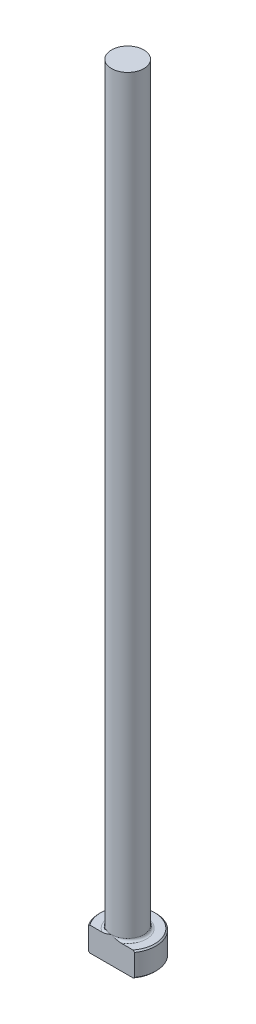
from build123d import *

# Parameters (mm, degrees)
CHAMFER1_SIZE = 0.254
FILLET1_R     = 0.508
KEY_DEPTH     = 153.60197502


with BuildPart() as part:
    # Sketch1 → Revolve1 (revolve)
    with BuildSketch(Plane.XY, mode=Mode.PRIVATE) as revolve1_sk:
        Polygon((0, 0), (-5.5499, 0), (-5.5499, 4.7498), (-3.175, 4.7498), (-3.175, 152.4), (0, 152.4), align=None)
    revolve(revolve1_sk.sketch.rotate(Axis((0, 259.958771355, 0), (0, -1, 0)), 270), axis=Axis((0, 259.958771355, 0), (0, -1, 0)))

    # Chamfer1
    chamfer1_edges = [part.edges().sort_by_distance(p)[0] for p in [
        (0, 4.7498, -5.5499),
        (0, 0, -5.5499),
    ]]
    chamfer(chamfer1_edges, length=CHAMFER1_SIZE)

    # Fillet1
    fillet1_edges = [part.edges().sort_by_distance(p)[0] for p in [
        (0, 4.7498, -3.175),
    ]]
    fillet(fillet1_edges, radius=FILLET1_R)

    # Sketch2 → Key (cut, through all)
    with BuildSketch(Plane(origin=(0, 0, 0), x_dir=(1, 0, 0), z_dir=(0, 1, 0))):
        with BuildLine():
            Line((-4.552006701, -3.175), (4.552006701, -3.175))
            ThreePointArc((4.552006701, -3.175), (0, -5.5499), (-4.552006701, -3.175))
        make_face()
    extrude(amount=KEY_DEPTH, mode=Mode.SUBTRACT)


solid = part.part
